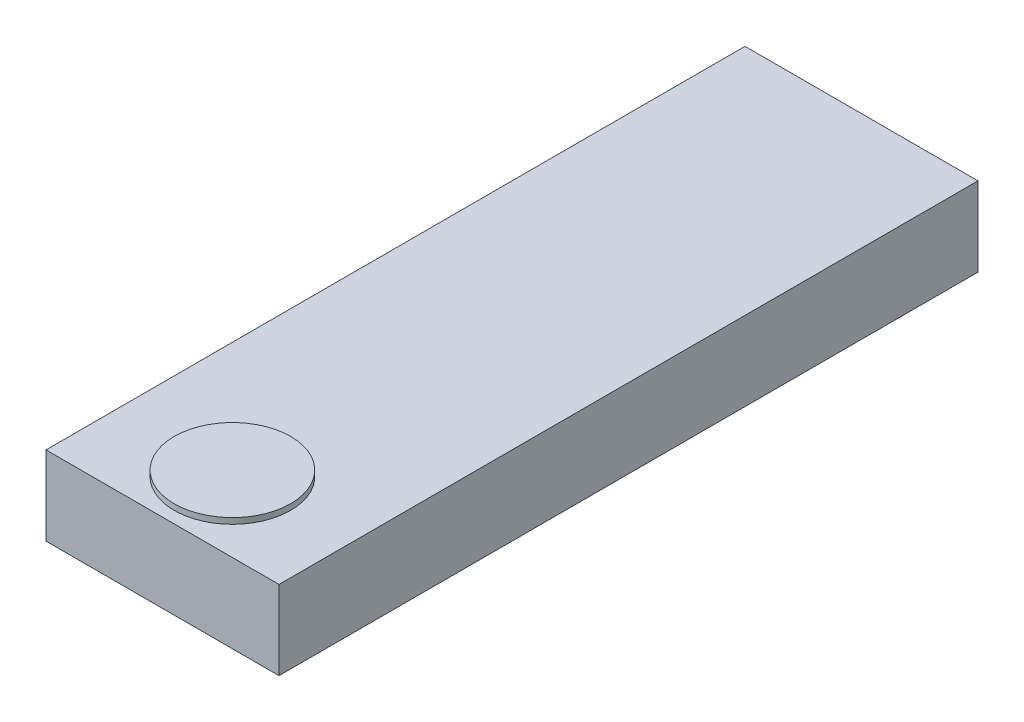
ISO-10303-21;
HEADER;
FILE_DESCRIPTION(('STEP AP214'),'2;1');
FILE_NAME('part.step','',(''),(''),'','','');
FILE_SCHEMA(('AUTOMOTIVE_DESIGN { 1 0 10303 214 1 1 1 1 }'));
ENDSEC;
DATA;
#1=APPLICATION_CONTEXT('core data for automotive mechanical design processes');
#2=APPLICATION_PROTOCOL_DEFINITION('international standard','automotive_design',2000,#1);
#3=PRODUCT_CONTEXT('',#1,'mechanical');
#4=PRODUCT('Part','Part','',(#3));
#5=PRODUCT_RELATED_PRODUCT_CATEGORY('part','',(#4));
#6=PRODUCT_DEFINITION_FORMATION('','',#4);
#7=PRODUCT_DEFINITION_CONTEXT('part definition',#1,'design');
#8=PRODUCT_DEFINITION('design','',#6,#7);
#9=PRODUCT_DEFINITION_SHAPE('','',#8);
#10=(LENGTH_UNIT() NAMED_UNIT(*) SI_UNIT(.MILLI.,.METRE.));
#11=(NAMED_UNIT(*) PLANE_ANGLE_UNIT() SI_UNIT($,.RADIAN.));
#12=(NAMED_UNIT(*) SI_UNIT($,.STERADIAN.) SOLID_ANGLE_UNIT());
#13=UNCERTAINTY_MEASURE_WITH_UNIT(LENGTH_MEASURE(1.E-05),#10,'distance_accuracy_value','');
#14=(GEOMETRIC_REPRESENTATION_CONTEXT(3) GLOBAL_UNCERTAINTY_ASSIGNED_CONTEXT((#13)) GLOBAL_UNIT_ASSIGNED_CONTEXT((#10,
#11,#12)) REPRESENTATION_CONTEXT('',''));
#15=CARTESIAN_POINT('',(0.,0.,0.));
#16=DIRECTION('',(0.,0.,1.));
#17=DIRECTION('',(1.,0.,0.));
#18=AXIS2_PLACEMENT_3D('',#15,#16,#17);
#19=CARTESIAN_POINT('',(-25.4,0.,152.4));
#20=DIRECTION('',(1.,0.,0.));
#21=DIRECTION('',(0.,0.,-1.));
#22=AXIS2_PLACEMENT_3D('',#19,#20,#21);
#23=PLANE('',#22);
#24=DIRECTION('',(0.,-1.,0.));
#25=VECTOR('',#24,1.);
#26=CARTESIAN_POINT('',(-25.4,0.,0.));
#27=LINE('',#26,#25);
#28=CARTESIAN_POINT('',(-25.4,0.,0.));
#29=VERTEX_POINT('',#28);
#30=CARTESIAN_POINT('',(-25.4,-17.2329960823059,0.));
#31=VERTEX_POINT('',#30);
#32=EDGE_CURVE('E105',#29,#31,#27,.T.);
#33=ORIENTED_EDGE('',*,*,#32,.T.);
#34=DIRECTION('',(0.,0.,-1.));
#35=VECTOR('',#34,1.);
#36=CARTESIAN_POINT('',(-25.4,-17.2329960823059,152.4));
#37=LINE('',#36,#35);
#38=CARTESIAN_POINT('',(-25.4,-17.2329960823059,152.4));
#39=VERTEX_POINT('',#38);
#40=EDGE_CURVE('E47',#39,#31,#37,.T.);
#41=ORIENTED_EDGE('',*,*,#40,.F.);
#42=DIRECTION('',(0.,-1.,0.));
#43=VECTOR('',#42,1.);
#44=CARTESIAN_POINT('',(-25.4,0.,152.4));
#45=LINE('',#44,#43);
#46=CARTESIAN_POINT('',(-25.4,0.,152.4));
#47=VERTEX_POINT('',#46);
#48=EDGE_CURVE('E91',#47,#39,#45,.T.);
#49=ORIENTED_EDGE('',*,*,#48,.F.);
#50=DIRECTION('',(0.,0.,-1.));
#51=VECTOR('',#50,1.);
#52=CARTESIAN_POINT('',(-25.4,0.,152.4));
#53=LINE('',#52,#51);
#54=EDGE_CURVE('E101',#47,#29,#53,.T.);
#55=ORIENTED_EDGE('',*,*,#54,.T.);
#56=EDGE_LOOP('',(#33,#41,#49,#55));
#57=FACE_BOUND('',#56,.T.);
#58=ADVANCED_FACE('F39',(#57),#23,.F.);
#59=CARTESIAN_POINT('',(-25.4,-17.2329960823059,152.4));
#60=DIRECTION('',(0.,1.,0.));
#61=DIRECTION('',(0.,0.,1.));
#62=AXIS2_PLACEMENT_3D('',#59,#60,#61);
#63=PLANE('',#62);
#64=DIRECTION('',(1.,0.,0.));
#65=VECTOR('',#64,1.);
#66=CARTESIAN_POINT('',(-25.4,-17.2329960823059,0.));
#67=LINE('',#66,#65);
#68=CARTESIAN_POINT('',(25.4,-17.2329960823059,0.));
#69=VERTEX_POINT('',#68);
#70=EDGE_CURVE('E96',#31,#69,#67,.T.);
#71=ORIENTED_EDGE('',*,*,#70,.T.);
#72=DIRECTION('',(0.,0.,-1.));
#73=VECTOR('',#72,1.);
#74=CARTESIAN_POINT('',(25.4,-17.2329960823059,152.4));
#75=LINE('',#74,#73);
#76=CARTESIAN_POINT('',(25.4,-17.2329960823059,152.4));
#77=VERTEX_POINT('',#76);
#78=EDGE_CURVE('E94',#77,#69,#75,.T.);
#79=ORIENTED_EDGE('',*,*,#78,.F.);
#80=DIRECTION('',(1.,0.,0.));
#81=VECTOR('',#80,1.);
#82=CARTESIAN_POINT('',(-25.4,-17.2329960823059,152.4));
#83=LINE('',#82,#81);
#84=EDGE_CURVE('E86',#39,#77,#83,.T.);
#85=ORIENTED_EDGE('',*,*,#84,.F.);
#86=ORIENTED_EDGE('',*,*,#40,.T.);
#87=EDGE_LOOP('',(#71,#79,#85,#86));
#88=FACE_BOUND('',#87,.T.);
#89=ADVANCED_FACE('F95',(#88),#63,.F.);
#90=CARTESIAN_POINT('',(25.4,0.,152.4));
#91=DIRECTION('',(-1.,0.,0.));
#92=DIRECTION('',(0.,0.,1.));
#93=AXIS2_PLACEMENT_3D('',#90,#91,#92);
#94=PLANE('',#93);
#95=DIRECTION('',(0.,1.,0.));
#96=VECTOR('',#95,1.);
#97=CARTESIAN_POINT('',(25.4,0.,0.));
#98=LINE('',#97,#96);
#99=CARTESIAN_POINT('',(25.4,0.,0.));
#100=VERTEX_POINT('',#99);
#101=EDGE_CURVE('E72',#69,#100,#98,.T.);
#102=ORIENTED_EDGE('',*,*,#101,.T.);
#103=DIRECTION('',(0.,0.,-1.));
#104=VECTOR('',#103,1.);
#105=CARTESIAN_POINT('',(25.4,0.,152.4));
#106=LINE('',#105,#104);
#107=CARTESIAN_POINT('',(25.4,0.,152.4));
#108=VERTEX_POINT('',#107);
#109=EDGE_CURVE('E97',#108,#100,#106,.T.);
#110=ORIENTED_EDGE('',*,*,#109,.F.);
#111=DIRECTION('',(0.,1.,0.));
#112=VECTOR('',#111,1.);
#113=CARTESIAN_POINT('',(25.4,0.,152.4));
#114=LINE('',#113,#112);
#115=EDGE_CURVE('E89',#77,#108,#114,.T.);
#116=ORIENTED_EDGE('',*,*,#115,.F.);
#117=ORIENTED_EDGE('',*,*,#78,.T.);
#118=EDGE_LOOP('',(#102,#110,#116,#117));
#119=FACE_BOUND('',#118,.T.);
#120=ADVANCED_FACE('F99',(#119),#94,.F.);
#121=CARTESIAN_POINT('',(-25.4,0.,152.4));
#122=DIRECTION('',(0.,-1.,0.));
#123=DIRECTION('',(0.,0.,-1.));
#124=AXIS2_PLACEMENT_3D('',#121,#122,#123);
#125=PLANE('',#124);
#126=CARTESIAN_POINT('',(0.,0.,137.16));
#127=DIRECTION('',(0.,-1.,0.));
#128=DIRECTION('',(0.,0.,-1.));
#129=AXIS2_PLACEMENT_3D('',#126,#127,#128);
#130=CIRCLE('',#129,12.7);
#131=CARTESIAN_POINT('',(0.,0.,124.46));
#132=VERTEX_POINT('',#131);
#133=EDGE_CURVE('E11',#132,#132,#130,.F.);
#134=ORIENTED_EDGE('',*,*,#133,.F.);
#135=EDGE_LOOP('',(#134));
#136=FACE_BOUND('',#135,.T.);
#137=DIRECTION('',(-1.,0.,0.));
#138=VECTOR('',#137,1.);
#139=CARTESIAN_POINT('',(-25.4,0.,0.));
#140=LINE('',#139,#138);
#141=EDGE_CURVE('E78',#100,#29,#140,.T.);
#142=ORIENTED_EDGE('',*,*,#141,.T.);
#143=ORIENTED_EDGE('',*,*,#54,.F.);
#144=DIRECTION('',(-1.,0.,0.));
#145=VECTOR('',#144,1.);
#146=CARTESIAN_POINT('',(-25.4,0.,152.4));
#147=LINE('',#146,#145);
#148=EDGE_CURVE('E55',#108,#47,#147,.T.);
#149=ORIENTED_EDGE('',*,*,#148,.F.);
#150=ORIENTED_EDGE('',*,*,#109,.T.);
#151=EDGE_LOOP('',(#142,#143,#149,#150));
#152=FACE_BOUND('',#151,.T.);
#153=ADVANCED_FACE('F127',(#136,#152),#125,.F.);
#154=CARTESIAN_POINT('',(0.,0.,152.4));
#155=DIRECTION('',(0.,0.,1.));
#156=DIRECTION('',(1.,0.,0.));
#157=AXIS2_PLACEMENT_3D('',#154,#155,#156);
#158=PLANE('',#157);
#159=ORIENTED_EDGE('',*,*,#48,.T.);
#160=ORIENTED_EDGE('',*,*,#84,.T.);
#161=ORIENTED_EDGE('',*,*,#115,.T.);
#162=ORIENTED_EDGE('',*,*,#148,.T.);
#163=EDGE_LOOP('',(#159,#160,#161,#162));
#164=FACE_BOUND('',#163,.T.);
#165=ADVANCED_FACE('F87',(#164),#158,.T.);
#166=CARTESIAN_POINT('',(0.,0.,0.));
#167=DIRECTION('',(0.,0.,1.));
#168=DIRECTION('',(1.,0.,0.));
#169=AXIS2_PLACEMENT_3D('',#166,#167,#168);
#170=PLANE('',#169);
#171=ORIENTED_EDGE('',*,*,#32,.F.);
#172=ORIENTED_EDGE('',*,*,#141,.F.);
#173=ORIENTED_EDGE('',*,*,#101,.F.);
#174=ORIENTED_EDGE('',*,*,#70,.F.);
#175=EDGE_LOOP('',(#171,#172,#173,#174));
#176=FACE_BOUND('',#175,.T.);
#177=ADVANCED_FACE('F116',(#176),#170,.F.);
#178=CARTESIAN_POINT('',(0.,1.27,137.16));
#179=DIRECTION('',(0.,-1.,0.));
#180=DIRECTION('',(0.,0.,-1.));
#181=AXIS2_PLACEMENT_3D('',#178,#179,#180);
#182=CYLINDRICAL_SURFACE('',#181,12.7);
#183=CARTESIAN_POINT('',(0.,1.27,137.16));
#184=DIRECTION('',(0.,1.,0.));
#185=DIRECTION('',(0.,0.,1.));
#186=AXIS2_PLACEMENT_3D('',#183,#184,#185);
#187=CIRCLE('',#186,12.7);
#188=CARTESIAN_POINT('',(0.,1.27,149.86));
#189=VERTEX_POINT('',#188);
#190=EDGE_CURVE('E108',#189,#189,#187,.T.);
#191=ORIENTED_EDGE('',*,*,#190,.F.);
#192=EDGE_LOOP('',(#191));
#193=FACE_BOUND('',#192,.T.);
#194=ORIENTED_EDGE('',*,*,#133,.T.);
#195=EDGE_LOOP('',(#194));
#196=FACE_BOUND('',#195,.T.);
#197=ADVANCED_FACE('F118',(#193,#196),#182,.T.);
#198=CARTESIAN_POINT('',(0.,1.27,137.16));
#199=DIRECTION('',(0.,1.,0.));
#200=DIRECTION('',(0.,0.,1.));
#201=AXIS2_PLACEMENT_3D('',#198,#199,#200);
#202=PLANE('',#201);
#203=ORIENTED_EDGE('',*,*,#190,.T.);
#204=EDGE_LOOP('',(#203));
#205=FACE_BOUND('',#204,.T.);
#206=ADVANCED_FACE('F124',(#205),#202,.T.);
#207=CLOSED_SHELL('',(#58,#89,#120,#153,#165,#177,#197,#206));
#208=MANIFOLD_SOLID_BREP('B2',#207);
#209=ADVANCED_BREP_SHAPE_REPRESENTATION('',(#18,#208),#14);
#210=SHAPE_DEFINITION_REPRESENTATION(#9,#209);
ENDSEC;
END-ISO-10303-21;
